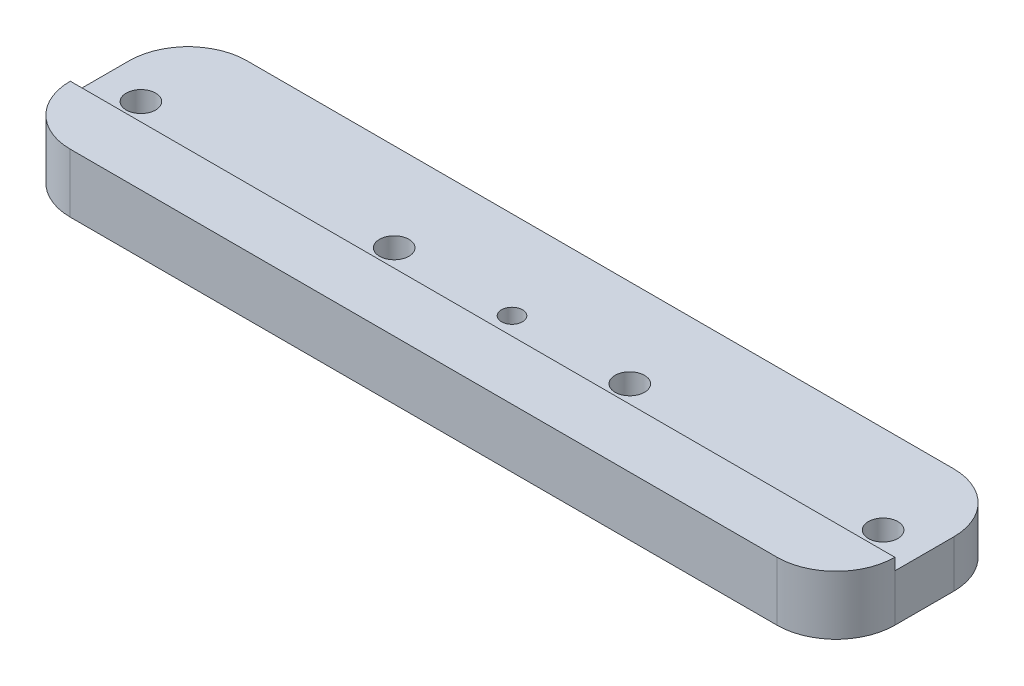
from build123d import *

# Parameters (mm, degrees)
SKETCH1_W                 = 88.9
SKETCH1_H                 = 19.05
EXTRUDE1_DEPTH            = 6.35
F_4_CLEARANCE_HOLE1_D     = 3.175
F_4_CLEARANCE_HOLE1_DEPTH = 9.398
F_4_CLEARANCE_HOLE1_TIP   = 0.953866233
FILLET1_R                 = 6.35
EXTRUDE3_DEPTH            = 1.27
F_4_40_TAPPED_HOLE1_D     = 2.2606
F_4_40_TAPPED_HOLE1_DEPTH = 7.62
F_4_40_TAPPED_HOLE1_TIP   = 0.679152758


with BuildPart() as part:
    # Sketch1 → Extrude1 (new body)
    with BuildSketch(Plane(origin=(0, 0, 0), x_dir=(1, 0, 0), z_dir=(0, 1, 0))):
        Rectangle(SKETCH1_W, SKETCH1_H)
    extrude(amount=EXTRUDE1_DEPTH)

    # 4 Clearance Hole1
    with Locations(Plane(origin=(-40.005, 6.35, 0), x_dir=(0, 0, 1), z_dir=(0, 1, 0))):
        with Locations((0, 0), (0, 80.01), (0, 27.305), (0, 52.705)):
            Hole(F_4_CLEARANCE_HOLE1_D / 2, depth=F_4_CLEARANCE_HOLE1_DEPTH)
            with Locations((0, 0, -(F_4_CLEARANCE_HOLE1_DEPTH + F_4_CLEARANCE_HOLE1_TIP / 2))):  # 118° drill point
                Cone(0, F_4_CLEARANCE_HOLE1_D / 2, F_4_CLEARANCE_HOLE1_TIP, mode=Mode.SUBTRACT)

    # Fillet1
    fillet1_edges = [part.edges().sort_by_distance(p)[0] for p in [
        (44.45, 3.175, 9.525),
        (-44.45, 3.175, 9.525),
        (-44.45, 3.175, -9.525),
        (44.45, 3.175, -9.525),
    ]]
    fillet(fillet1_edges, radius=FILLET1_R)

    # Sketch7 → Extrude3 (cut)
    with BuildSketch(Plane(origin=(0, 6.35, 0), x_dir=(1, 0, 0), z_dir=(0, 1, 0))):
        with BuildLine():
            Line((-44.45, -3.175), (44.45, -3.175))
            Line((44.45, -3.175), (44.45, 3.175))
            ThreePointArc((44.45, 3.175), (42.590128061, 7.665128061), (38.1, 9.525))
            Line((38.1, 9.525), (-38.1, 9.525))
            ThreePointArc((-38.1, 9.525), (-42.590128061, 7.665128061), (-44.45, 3.175))
            Line((-44.45, 3.175), (-44.45, -3.175))
        make_face()
    extrude(amount=-EXTRUDE3_DEPTH, mode=Mode.SUBTRACT)

    # 4-40 Tapped Hole1
    with Locations(Plane(origin=(0, 5.08, 0), x_dir=(-1, 0, 0), z_dir=(0, 1, 0))):
        with Locations((0, 0)):
            Hole(F_4_40_TAPPED_HOLE1_D / 2, depth=F_4_40_TAPPED_HOLE1_DEPTH)
            with Locations((0, 0, -(F_4_40_TAPPED_HOLE1_DEPTH + F_4_40_TAPPED_HOLE1_TIP / 2))):  # 118° drill point
                Cone(0, F_4_40_TAPPED_HOLE1_D / 2, F_4_40_TAPPED_HOLE1_TIP, mode=Mode.SUBTRACT)


solid = part.part
